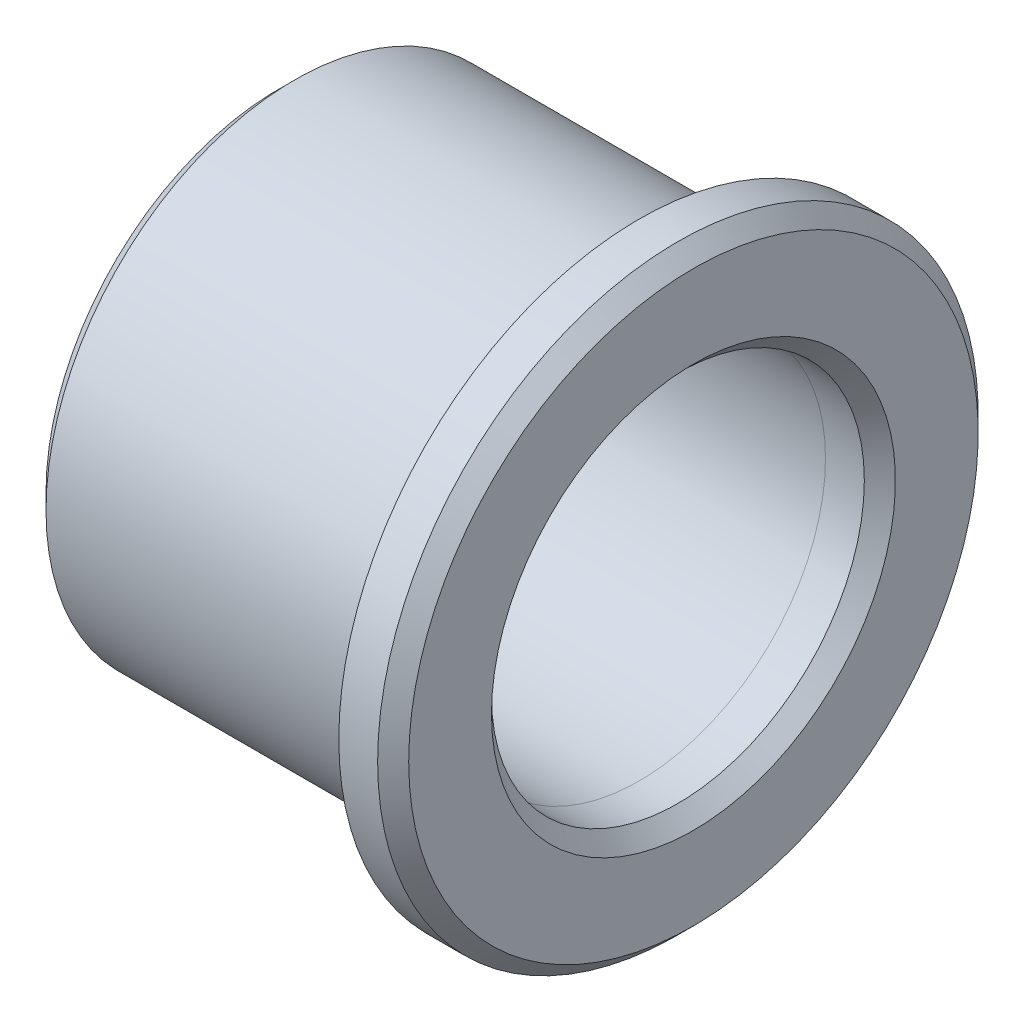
ISO-10303-21;
HEADER;
FILE_DESCRIPTION(('STEP AP214'),'2;1');
FILE_NAME('part.step','',(''),(''),'','','');
FILE_SCHEMA(('AUTOMOTIVE_DESIGN { 1 0 10303 214 1 1 1 1 }'));
ENDSEC;
DATA;
#1=APPLICATION_CONTEXT('core data for automotive mechanical design processes');
#2=APPLICATION_PROTOCOL_DEFINITION('international standard','automotive_design',2000,#1);
#3=PRODUCT_CONTEXT('',#1,'mechanical');
#4=PRODUCT('Part','Part','',(#3));
#5=PRODUCT_RELATED_PRODUCT_CATEGORY('part','',(#4));
#6=PRODUCT_DEFINITION_FORMATION('','',#4);
#7=PRODUCT_DEFINITION_CONTEXT('part definition',#1,'design');
#8=PRODUCT_DEFINITION('design','',#6,#7);
#9=PRODUCT_DEFINITION_SHAPE('','',#8);
#10=(LENGTH_UNIT() NAMED_UNIT(*) SI_UNIT(.MILLI.,.METRE.));
#11=(NAMED_UNIT(*) PLANE_ANGLE_UNIT() SI_UNIT($,.RADIAN.));
#12=(NAMED_UNIT(*) SI_UNIT($,.STERADIAN.) SOLID_ANGLE_UNIT());
#13=UNCERTAINTY_MEASURE_WITH_UNIT(LENGTH_MEASURE(1.E-05),#10,'distance_accuracy_value','');
#14=(GEOMETRIC_REPRESENTATION_CONTEXT(3) GLOBAL_UNCERTAINTY_ASSIGNED_CONTEXT((#13)) GLOBAL_UNIT_ASSIGNED_CONTEXT((#10,
#11,#12)) REPRESENTATION_CONTEXT('',''));
#15=CARTESIAN_POINT('',(0.,0.,0.));
#16=DIRECTION('',(0.,0.,1.));
#17=DIRECTION('',(1.,0.,0.));
#18=AXIS2_PLACEMENT_3D('',#15,#16,#17);
#19=CARTESIAN_POINT('',(30.3270796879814,-158.823578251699,-154.849934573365));
#20=DIRECTION('',(1.,0.,0.));
#21=DIRECTION('',(0.,0.,-1.));
#22=AXIS2_PLACEMENT_3D('',#19,#20,#21);
#23=PLANE('',#22);
#24=CARTESIAN_POINT('',(30.3270796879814,-170.823977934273,-154.849934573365));
#25=DIRECTION('',(1.,0.,0.));
#26=DIRECTION('',(0.,0.,-1.));
#27=AXIS2_PLACEMENT_3D('',#24,#25,#26);
#28=CIRCLE('',#27,13.0003996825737);
#29=CARTESIAN_POINT('',(30.3270796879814,-170.823977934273,-167.850334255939));
#30=VERTEX_POINT('',#29);
#31=EDGE_CURVE('E43',#30,#30,#28,.T.);
#32=ORIENTED_EDGE('',*,*,#31,.T.);
#33=EDGE_LOOP('',(#32));
#34=FACE_BOUND('',#33,.T.);
#35=CARTESIAN_POINT('',(30.3270796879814,-170.823977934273,-154.849934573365));
#36=DIRECTION('',(1.,0.,0.));
#37=DIRECTION('',(0.,0.,-1.));
#38=AXIS2_PLACEMENT_3D('',#35,#36,#37);
#39=CIRCLE('',#38,15.);
#40=CARTESIAN_POINT('',(30.3270796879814,-170.823977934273,-169.849934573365));
#41=VERTEX_POINT('',#40);
#42=EDGE_CURVE('E47',#41,#41,#39,.F.);
#43=ORIENTED_EDGE('',*,*,#42,.T.);
#44=EDGE_LOOP('',(#43));
#45=FACE_BOUND('',#44,.T.);
#46=ADVANCED_FACE('F32',(#34,#45),#23,.F.);
#47=CARTESIAN_POINT('',(16.8957158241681,-170.823977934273,-154.849934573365));
#48=DIRECTION('',(-1.,0.,0.));
#49=DIRECTION('',(0.,0.,1.));
#50=AXIS2_PLACEMENT_3D('',#47,#48,#49);
#51=CYLINDRICAL_SURFACE('',#50,12.0003996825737);
#52=CARTESIAN_POINT('',(31.3270796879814,-170.823977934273,-154.849934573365));
#53=DIRECTION('',(1.,0.,0.));
#54=DIRECTION('',(0.,0.,-1.));
#55=AXIS2_PLACEMENT_3D('',#52,#53,#54);
#56=CIRCLE('',#55,12.0003996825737);
#57=CARTESIAN_POINT('',(31.3270796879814,-170.823977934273,-166.850334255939));
#58=VERTEX_POINT('',#57);
#59=EDGE_CURVE('E52',#58,#58,#56,.F.);
#60=ORIENTED_EDGE('',*,*,#59,.T.);
#61=EDGE_LOOP('',(#60));
#62=FACE_BOUND('',#61,.T.);
#63=CARTESIAN_POINT('',(53.4999999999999,-170.823977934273,-154.849934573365));
#64=DIRECTION('',(-1.,0.,0.));
#65=DIRECTION('',(0.,0.,1.));
#66=AXIS2_PLACEMENT_3D('',#63,#64,#65);
#67=CIRCLE('',#66,12.0003996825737);
#68=CARTESIAN_POINT('',(53.4999999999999,-170.823977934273,-142.849534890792));
#69=VERTEX_POINT('',#68);
#70=EDGE_CURVE('E64',#69,#69,#67,.T.);
#71=ORIENTED_EDGE('',*,*,#70,.F.);
#72=EDGE_LOOP('',(#71));
#73=FACE_BOUND('',#72,.T.);
#74=ADVANCED_FACE('F106',(#62,#73),#51,.F.);
#75=CARTESIAN_POINT('',(53.4999999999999,-158.823578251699,-154.849934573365));
#76=DIRECTION('',(1.,0.,0.));
#77=DIRECTION('',(0.,0.,-1.));
#78=AXIS2_PLACEMENT_3D('',#75,#76,#77);
#79=PLANE('',#78);
#80=CARTESIAN_POINT('',(53.4999999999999,-170.823977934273,-154.849934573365));
#81=DIRECTION('',(-1.,0.,0.));
#82=DIRECTION('',(0.,0.,1.));
#83=AXIS2_PLACEMENT_3D('',#80,#81,#82);
#84=CIRCLE('',#83,12.);
#85=CARTESIAN_POINT('',(53.4999999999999,-170.823977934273,-142.849934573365));
#86=VERTEX_POINT('',#85);
#87=EDGE_CURVE('E67',#86,#86,#84,.T.);
#88=ORIENTED_EDGE('',*,*,#87,.F.);
#89=EDGE_LOOP('',(#88));
#90=FACE_BOUND('',#89,.T.);
#91=ORIENTED_EDGE('',*,*,#70,.T.);
#92=EDGE_LOOP('',(#91));
#93=FACE_BOUND('',#92,.T.);
#94=ADVANCED_FACE('F112',(#90,#93),#79,.F.);
#95=CARTESIAN_POINT('',(16.8957158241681,-170.823977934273,-154.849934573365));
#96=DIRECTION('',(-1.,0.,0.));
#97=DIRECTION('',(0.,0.,1.));
#98=AXIS2_PLACEMENT_3D('',#95,#96,#97);
#99=CYLINDRICAL_SURFACE('',#98,12.);
#100=CARTESIAN_POINT('',(55.9999999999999,-170.823977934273,-154.849934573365));
#101=DIRECTION('',(-1.,0.,0.));
#102=DIRECTION('',(0.,0.,1.));
#103=AXIS2_PLACEMENT_3D('',#100,#101,#102);
#104=CIRCLE('',#103,12.);
#105=CARTESIAN_POINT('',(55.9999999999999,-170.823977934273,-142.849934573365));
#106=VERTEX_POINT('',#105);
#107=EDGE_CURVE('E39',#106,#106,#104,.F.);
#108=ORIENTED_EDGE('',*,*,#107,.T.);
#109=EDGE_LOOP('',(#108));
#110=FACE_BOUND('',#109,.T.);
#111=ORIENTED_EDGE('',*,*,#87,.T.);
#112=EDGE_LOOP('',(#111));
#113=FACE_BOUND('',#112,.T.);
#114=ADVANCED_FACE('F102',(#110,#113),#99,.F.);
#115=CARTESIAN_POINT('',(56.9999999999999,-151.496120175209,-154.849934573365));
#116=DIRECTION('',(-1.,0.,0.));
#117=DIRECTION('',(0.,0.,1.));
#118=AXIS2_PLACEMENT_3D('',#115,#116,#117);
#119=PLANE('',#118);
#120=CARTESIAN_POINT('',(56.9999999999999,-170.823977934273,-154.849934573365));
#121=DIRECTION('',(-1.,0.,0.));
#122=DIRECTION('',(0.,0.,1.));
#123=AXIS2_PLACEMENT_3D('',#120,#121,#122);
#124=CIRCLE('',#123,18.327857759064);
#125=CARTESIAN_POINT('',(56.9999999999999,-170.823977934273,-136.522076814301));
#126=VERTEX_POINT('',#125);
#127=EDGE_CURVE('E55',#126,#126,#124,.F.);
#128=ORIENTED_EDGE('',*,*,#127,.T.);
#129=EDGE_LOOP('',(#128));
#130=FACE_BOUND('',#129,.T.);
#131=CARTESIAN_POINT('',(56.9999999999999,-170.823977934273,-154.849934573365));
#132=DIRECTION('',(-1.,0.,0.));
#133=DIRECTION('',(0.,0.,1.));
#134=AXIS2_PLACEMENT_3D('',#131,#132,#133);
#135=CIRCLE('',#134,13.);
#136=CARTESIAN_POINT('',(56.9999999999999,-170.823977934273,-141.849934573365));
#137=VERTEX_POINT('',#136);
#138=EDGE_CURVE('E58',#137,#137,#135,.T.);
#139=ORIENTED_EDGE('',*,*,#138,.T.);
#140=EDGE_LOOP('',(#139));
#141=FACE_BOUND('',#140,.T.);
#142=ADVANCED_FACE('F96',(#130,#141),#119,.F.);
#143=CARTESIAN_POINT('',(16.8957158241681,-170.823977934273,-154.849934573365));
#144=DIRECTION('',(-1.,0.,0.));
#145=DIRECTION('',(0.,0.,1.));
#146=AXIS2_PLACEMENT_3D('',#143,#144,#145);
#147=CYLINDRICAL_SURFACE('',#146,19.327857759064);
#148=CARTESIAN_POINT('',(55.9999999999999,-170.823977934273,-154.849934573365));
#149=DIRECTION('',(-1.,0.,0.));
#150=DIRECTION('',(0.,0.,1.));
#151=AXIS2_PLACEMENT_3D('',#148,#149,#150);
#152=CIRCLE('',#151,19.327857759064);
#153=CARTESIAN_POINT('',(55.9999999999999,-170.823977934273,-135.522076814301));
#154=VERTEX_POINT('',#153);
#155=EDGE_CURVE('E61',#154,#154,#152,.T.);
#156=ORIENTED_EDGE('',*,*,#155,.T.);
#157=EDGE_LOOP('',(#156));
#158=FACE_BOUND('',#157,.T.);
#159=CARTESIAN_POINT('',(53.4999999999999,-170.823977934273,-154.849934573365));
#160=DIRECTION('',(-1.,0.,0.));
#161=DIRECTION('',(0.,0.,1.));
#162=AXIS2_PLACEMENT_3D('',#159,#160,#161);
#163=CIRCLE('',#162,19.327857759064);
#164=CARTESIAN_POINT('',(53.4999999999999,-170.823977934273,-135.522076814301));
#165=VERTEX_POINT('',#164);
#166=EDGE_CURVE('E70',#165,#165,#163,.T.);
#167=ORIENTED_EDGE('',*,*,#166,.F.);
#168=EDGE_LOOP('',(#167));
#169=FACE_BOUND('',#168,.T.);
#170=ADVANCED_FACE('F91',(#158,#169),#147,.T.);
#171=CARTESIAN_POINT('',(53.4999999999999,-151.496120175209,-154.849934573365));
#172=DIRECTION('',(1.,0.,0.));
#173=DIRECTION('',(0.,0.,-1.));
#174=AXIS2_PLACEMENT_3D('',#171,#172,#173);
#175=PLANE('',#174);
#176=CARTESIAN_POINT('',(53.4999999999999,-170.823977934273,-154.849934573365));
#177=DIRECTION('',(-1.,0.,0.));
#178=DIRECTION('',(0.,0.,1.));
#179=AXIS2_PLACEMENT_3D('',#176,#177,#178);
#180=CIRCLE('',#179,16.423774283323);
#181=CARTESIAN_POINT('',(53.4999999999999,-170.823977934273,-138.426160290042));
#182=VERTEX_POINT('',#181);
#183=EDGE_CURVE('E73',#182,#182,#180,.T.);
#184=ORIENTED_EDGE('',*,*,#183,.F.);
#185=EDGE_LOOP('',(#184));
#186=FACE_BOUND('',#185,.T.);
#187=ORIENTED_EDGE('',*,*,#166,.T.);
#188=EDGE_LOOP('',(#187));
#189=FACE_BOUND('',#188,.T.);
#190=ADVANCED_FACE('F85',(#186,#189),#175,.F.);
#191=CARTESIAN_POINT('',(53.3395923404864,-170.823977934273,-154.849934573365));
#192=DIRECTION('',(-1.,0.,0.));
#193=DIRECTION('',(0.,0.,1.));
#194=AXIS2_PLACEMENT_3D('',#191,#192,#193);
#195=TOROIDAL_SURFACE('',#194,16.1604076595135,0.308370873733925);
#196=CARTESIAN_POINT('',(53.0762257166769,-170.823977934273,-154.849934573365));
#197=DIRECTION('',(-1.,0.,0.));
#198=DIRECTION('',(0.,0.,1.));
#199=AXIS2_PLACEMENT_3D('',#196,#197,#198);
#200=CIRCLE('',#199,16.);
#201=CARTESIAN_POINT('',(53.0762257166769,-170.823977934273,-138.849934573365));
#202=VERTEX_POINT('',#201);
#203=EDGE_CURVE('E76',#202,#202,#200,.T.);
#204=ORIENTED_EDGE('',*,*,#203,.F.);
#205=EDGE_LOOP('',(#204));
#206=FACE_BOUND('',#205,.T.);
#207=ORIENTED_EDGE('',*,*,#183,.T.);
#208=EDGE_LOOP('',(#207));
#209=FACE_BOUND('',#208,.T.);
#210=ADVANCED_FACE('F82',(#206,#209),#195,.F.);
#211=CARTESIAN_POINT('',(16.8957158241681,-170.823977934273,-154.849934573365));
#212=DIRECTION('',(-1.,0.,0.));
#213=DIRECTION('',(0.,0.,1.));
#214=AXIS2_PLACEMENT_3D('',#211,#212,#213);
#215=CYLINDRICAL_SURFACE('',#214,16.);
#216=CARTESIAN_POINT('',(31.3270796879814,-170.823977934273,-154.849934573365));
#217=DIRECTION('',(1.,0.,0.));
#218=DIRECTION('',(0.,0.,-1.));
#219=AXIS2_PLACEMENT_3D('',#216,#217,#218);
#220=CIRCLE('',#219,16.);
#221=CARTESIAN_POINT('',(31.3270796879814,-170.823977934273,-170.849934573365));
#222=VERTEX_POINT('',#221);
#223=EDGE_CURVE('E10',#222,#222,#220,.T.);
#224=ORIENTED_EDGE('',*,*,#223,.T.);
#225=EDGE_LOOP('',(#224));
#226=FACE_BOUND('',#225,.T.);
#227=ORIENTED_EDGE('',*,*,#203,.T.);
#228=EDGE_LOOP('',(#227));
#229=FACE_BOUND('',#228,.T.);
#230=ADVANCED_FACE('F80',(#226,#229),#215,.T.);
#231=CARTESIAN_POINT('',(55.9999999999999,-170.823977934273,-154.849934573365));
#232=DIRECTION('',(-1.,0.,0.));
#233=DIRECTION('',(0.,0.,1.));
#234=AXIS2_PLACEMENT_3D('',#231,#232,#233);
#235=CONICAL_SURFACE('',#234,19.327857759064,0.785398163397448);
#236=ORIENTED_EDGE('',*,*,#127,.F.);
#237=EDGE_LOOP('',(#236));
#238=FACE_BOUND('',#237,.T.);
#239=ORIENTED_EDGE('',*,*,#155,.F.);
#240=EDGE_LOOP('',(#239));
#241=FACE_BOUND('',#240,.T.);
#242=ADVANCED_FACE('F118',(#238,#241),#235,.T.);
#243=CARTESIAN_POINT('',(31.3270796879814,-170.823977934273,-154.849934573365));
#244=DIRECTION('',(-1.,0.,0.));
#245=DIRECTION('',(0.,0.,1.));
#246=AXIS2_PLACEMENT_3D('',#243,#244,#245);
#247=CONICAL_SURFACE('',#246,12.0003996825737,0.785398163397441);
#248=ORIENTED_EDGE('',*,*,#31,.F.);
#249=EDGE_LOOP('',(#248));
#250=FACE_BOUND('',#249,.T.);
#251=ORIENTED_EDGE('',*,*,#59,.F.);
#252=EDGE_LOOP('',(#251));
#253=FACE_BOUND('',#252,.T.);
#254=ADVANCED_FACE('F121',(#250,#253),#247,.F.);
#255=CARTESIAN_POINT('',(56.9999999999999,-170.823977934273,-154.849934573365));
#256=DIRECTION('',(1.,0.,0.));
#257=DIRECTION('',(0.,0.,-1.));
#258=AXIS2_PLACEMENT_3D('',#255,#256,#257);
#259=CONICAL_SURFACE('',#258,13.,0.785398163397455);
#260=ORIENTED_EDGE('',*,*,#107,.F.);
#261=EDGE_LOOP('',(#260));
#262=FACE_BOUND('',#261,.T.);
#263=ORIENTED_EDGE('',*,*,#138,.F.);
#264=EDGE_LOOP('',(#263));
#265=FACE_BOUND('',#264,.T.);
#266=ADVANCED_FACE('F124',(#262,#265),#259,.F.);
#267=CARTESIAN_POINT('',(30.3270796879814,-170.823977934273,-154.849934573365));
#268=DIRECTION('',(1.,0.,0.));
#269=DIRECTION('',(0.,0.,-1.));
#270=AXIS2_PLACEMENT_3D('',#267,#268,#269);
#271=CONICAL_SURFACE('',#270,15.,0.785398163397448);
#272=ORIENTED_EDGE('',*,*,#223,.F.);
#273=EDGE_LOOP('',(#272));
#274=FACE_BOUND('',#273,.T.);
#275=ORIENTED_EDGE('',*,*,#42,.F.);
#276=EDGE_LOOP('',(#275));
#277=FACE_BOUND('',#276,.T.);
#278=ADVANCED_FACE('F34',(#274,#277),#271,.T.);
#279=CLOSED_SHELL('',(#46,#74,#94,#114,#142,#170,#190,#210,#230,#242,#254,#266,#278));
#280=MANIFOLD_SOLID_BREP('B2',#279);
#281=ADVANCED_BREP_SHAPE_REPRESENTATION('',(#18,#280),#14);
#282=SHAPE_DEFINITION_REPRESENTATION(#9,#281);
ENDSEC;
END-ISO-10303-21;
